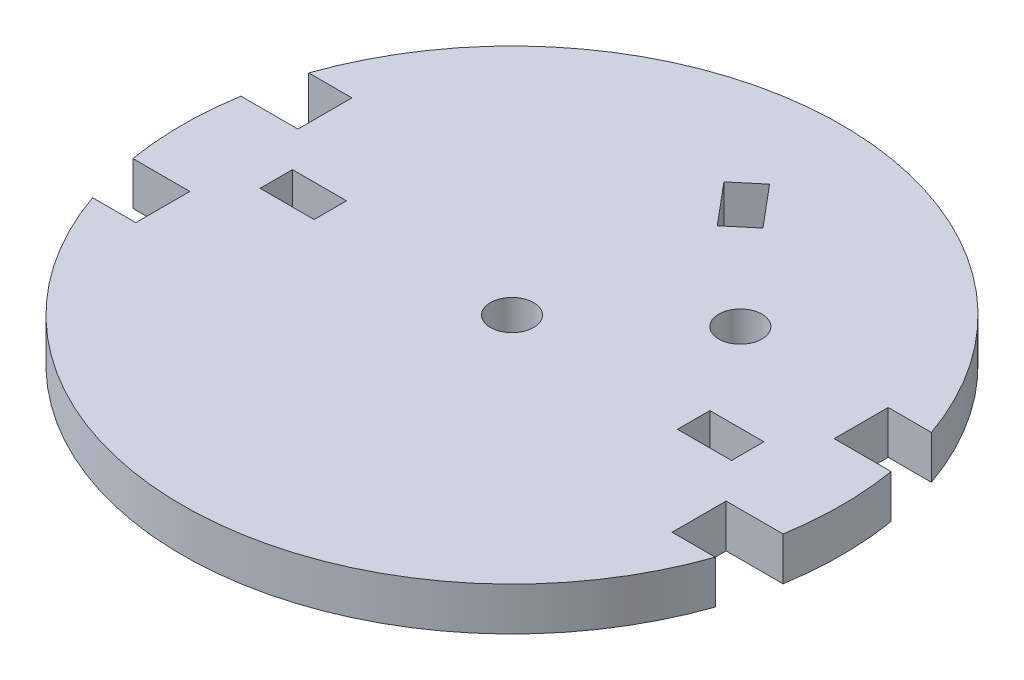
ISO-10303-21;
HEADER;
FILE_DESCRIPTION(('STEP AP214'),'2;1');
FILE_NAME('part.step','',(''),(''),'','','');
FILE_SCHEMA(('AUTOMOTIVE_DESIGN { 1 0 10303 214 1 1 1 1 }'));
ENDSEC;
DATA;
#1=APPLICATION_CONTEXT('core data for automotive mechanical design processes');
#2=APPLICATION_PROTOCOL_DEFINITION('international standard','automotive_design',2000,#1);
#3=PRODUCT_CONTEXT('',#1,'mechanical');
#4=PRODUCT('Part','Part','',(#3));
#5=PRODUCT_RELATED_PRODUCT_CATEGORY('part','',(#4));
#6=PRODUCT_DEFINITION_FORMATION('','',#4);
#7=PRODUCT_DEFINITION_CONTEXT('part definition',#1,'design');
#8=PRODUCT_DEFINITION('design','',#6,#7);
#9=PRODUCT_DEFINITION_SHAPE('','',#8);
#10=(LENGTH_UNIT() NAMED_UNIT(*) SI_UNIT(.MILLI.,.METRE.));
#11=(NAMED_UNIT(*) PLANE_ANGLE_UNIT() SI_UNIT($,.RADIAN.));
#12=(NAMED_UNIT(*) SI_UNIT($,.STERADIAN.) SOLID_ANGLE_UNIT());
#13=UNCERTAINTY_MEASURE_WITH_UNIT(LENGTH_MEASURE(1.E-05),#10,'distance_accuracy_value','');
#14=(GEOMETRIC_REPRESENTATION_CONTEXT(3) GLOBAL_UNCERTAINTY_ASSIGNED_CONTEXT((#13)) GLOBAL_UNIT_ASSIGNED_CONTEXT((#10,
#11,#12)) REPRESENTATION_CONTEXT('',''));
#15=CARTESIAN_POINT('',(0.,0.,0.));
#16=DIRECTION('',(0.,0.,1.));
#17=DIRECTION('',(1.,0.,0.));
#18=AXIS2_PLACEMENT_3D('',#15,#16,#17);
#19=CARTESIAN_POINT('',(0.,4.,0.));
#20=DIRECTION('',(0.,1.,0.));
#21=DIRECTION('',(0.,0.,1.));
#22=AXIS2_PLACEMENT_3D('',#19,#20,#21);
#23=PLANE('',#22);
#24=DIRECTION('',(0.,0.,1.));
#25=VECTOR('',#24,1.);
#26=CARTESIAN_POINT('',(24.8140590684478,4.,0.));
#27=LINE('',#26,#25);
#28=CARTESIAN_POINT('',(24.8140590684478,4.,5.));
#29=VERTEX_POINT('',#28);
#30=CARTESIAN_POINT('',(24.8140590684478,4.,10.));
#31=VERTEX_POINT('',#30);
#32=EDGE_CURVE('E321',#29,#31,#27,.T.);
#33=ORIENTED_EDGE('',*,*,#32,.F.);
#34=DIRECTION('',(1.,0.,0.));
#35=VECTOR('',#34,1.);
#36=CARTESIAN_POINT('',(0.,4.,5.));
#37=LINE('',#36,#35);
#38=CARTESIAN_POINT('',(30.0873727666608,4.,5.));
#39=VERTEX_POINT('',#38);
#40=EDGE_CURVE('E332',#29,#39,#37,.T.);
#41=ORIENTED_EDGE('',*,*,#40,.T.);
#42=CARTESIAN_POINT('',(0.,4.,0.));
#43=DIRECTION('',(0.,1.,0.));
#44=DIRECTION('',(0.,0.,1.));
#45=AXIS2_PLACEMENT_3D('',#42,#43,#44);
#46=CIRCLE('',#45,30.5);
#47=CARTESIAN_POINT('',(30.0873727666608,4.,-5.));
#48=VERTEX_POINT('',#47);
#49=EDGE_CURVE('E44',#39,#48,#46,.T.);
#50=ORIENTED_EDGE('',*,*,#49,.T.);
#51=DIRECTION('',(1.,0.,0.));
#52=VECTOR('',#51,1.);
#53=CARTESIAN_POINT('',(0.,4.,-5.00000000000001));
#54=LINE('',#53,#52);
#55=CARTESIAN_POINT('',(24.8140590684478,4.,-5.));
#56=VERTEX_POINT('',#55);
#57=EDGE_CURVE('E356',#56,#48,#54,.T.);
#58=ORIENTED_EDGE('',*,*,#57,.F.);
#59=DIRECTION('',(0.,0.,-1.));
#60=VECTOR('',#59,1.);
#61=CARTESIAN_POINT('',(24.8140590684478,4.,0.));
#62=LINE('',#61,#60);
#63=CARTESIAN_POINT('',(24.8140590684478,4.,-10.));
#64=VERTEX_POINT('',#63);
#65=EDGE_CURVE('E364',#56,#64,#62,.T.);
#66=ORIENTED_EDGE('',*,*,#65,.T.);
#67=DIRECTION('',(1.,0.,0.));
#68=VECTOR('',#67,1.);
#69=CARTESIAN_POINT('',(0.,4.,-10.));
#70=LINE('',#69,#68);
#71=CARTESIAN_POINT('',(28.8140590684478,4.,-10.));
#72=VERTEX_POINT('',#71);
#73=EDGE_CURVE('E346',#64,#72,#70,.T.);
#74=ORIENTED_EDGE('',*,*,#73,.T.);
#75=CARTESIAN_POINT('',(-28.8140590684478,4.,-10.));
#76=VERTEX_POINT('',#75);
#77=EDGE_CURVE('E589',#72,#76,#46,.T.);
#78=ORIENTED_EDGE('',*,*,#77,.T.);
#79=DIRECTION('',(-1.,0.,0.));
#80=VECTOR('',#79,1.);
#81=CARTESIAN_POINT('',(0.,4.,-10.));
#82=LINE('',#81,#80);
#83=CARTESIAN_POINT('',(-24.8140590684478,4.,-10.));
#84=VERTEX_POINT('',#83);
#85=EDGE_CURVE('E381',#84,#76,#82,.T.);
#86=ORIENTED_EDGE('',*,*,#85,.F.);
#87=DIRECTION('',(0.,0.,-1.));
#88=VECTOR('',#87,1.);
#89=CARTESIAN_POINT('',(-24.8140590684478,4.,0.));
#90=LINE('',#89,#88);
#91=CARTESIAN_POINT('',(-24.8140590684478,4.,-5.));
#92=VERTEX_POINT('',#91);
#93=EDGE_CURVE('E390',#92,#84,#90,.T.);
#94=ORIENTED_EDGE('',*,*,#93,.F.);
#95=DIRECTION('',(-1.,0.,0.));
#96=VECTOR('',#95,1.);
#97=CARTESIAN_POINT('',(0.,4.,-5.));
#98=LINE('',#97,#96);
#99=CARTESIAN_POINT('',(-30.0873727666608,4.,-5.));
#100=VERTEX_POINT('',#99);
#101=EDGE_CURVE('E371',#92,#100,#98,.T.);
#102=ORIENTED_EDGE('',*,*,#101,.T.);
#103=CARTESIAN_POINT('',(-30.0873727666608,4.,5.));
#104=VERTEX_POINT('',#103);
#105=EDGE_CURVE('E45',#100,#104,#46,.T.);
#106=ORIENTED_EDGE('',*,*,#105,.T.);
#107=DIRECTION('',(-1.,0.,0.));
#108=VECTOR('',#107,1.);
#109=CARTESIAN_POINT('',(0.,4.,5.00000000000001));
#110=LINE('',#109,#108);
#111=CARTESIAN_POINT('',(-24.8140590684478,4.,5.));
#112=VERTEX_POINT('',#111);
#113=EDGE_CURVE('E397',#112,#104,#110,.T.);
#114=ORIENTED_EDGE('',*,*,#113,.F.);
#115=DIRECTION('',(0.,0.,1.));
#116=VECTOR('',#115,1.);
#117=CARTESIAN_POINT('',(-24.8140590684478,4.,0.));
#118=LINE('',#117,#116);
#119=CARTESIAN_POINT('',(-24.8140590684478,4.,10.));
#120=VERTEX_POINT('',#119);
#121=EDGE_CURVE('E408',#112,#120,#118,.T.);
#122=ORIENTED_EDGE('',*,*,#121,.T.);
#123=DIRECTION('',(-1.,0.,0.));
#124=VECTOR('',#123,1.);
#125=CARTESIAN_POINT('',(0.,4.,10.));
#126=LINE('',#125,#124);
#127=CARTESIAN_POINT('',(-28.8140590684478,4.,10.));
#128=VERTEX_POINT('',#127);
#129=EDGE_CURVE('E416',#120,#128,#126,.T.);
#130=ORIENTED_EDGE('',*,*,#129,.T.);
#131=CARTESIAN_POINT('',(28.8140590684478,4.,10.));
#132=VERTEX_POINT('',#131);
#133=EDGE_CURVE('E11',#128,#132,#46,.T.);
#134=ORIENTED_EDGE('',*,*,#133,.T.);
#135=DIRECTION('',(1.,0.,0.));
#136=VECTOR('',#135,1.);
#137=CARTESIAN_POINT('',(0.,4.,10.));
#138=LINE('',#137,#136);
#139=EDGE_CURVE('E340',#31,#132,#138,.T.);
#140=ORIENTED_EDGE('',*,*,#139,.F.);
#141=EDGE_LOOP('',(#33,#41,#50,#58,#66,#74,#78,#86,#94,#102,#106,#114,#122,#130,#134,#140));
#142=FACE_BOUND('',#141,.T.);
#143=CARTESIAN_POINT('',(0.,4.,0.));
#144=DIRECTION('',(0.,1.,0.));
#145=DIRECTION('',(0.,0.,1.));
#146=AXIS2_PLACEMENT_3D('',#143,#144,#145);
#147=CIRCLE('',#146,2.);
#148=CARTESIAN_POINT('',(0.,4.,2.));
#149=VERTEX_POINT('',#148);
#150=EDGE_CURVE('E423',#149,#149,#147,.T.);
#151=ORIENTED_EDGE('',*,*,#150,.F.);
#152=EDGE_LOOP('',(#151));
#153=FACE_BOUND('',#152,.T.);
#154=DIRECTION('',(1.,0.,0.));
#155=VECTOR('',#154,1.);
#156=CARTESIAN_POINT('',(-16.8140590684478,4.,1.5));
#157=LINE('',#156,#155);
#158=CARTESIAN_POINT('',(-21.8140590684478,4.,1.5));
#159=VERTEX_POINT('',#158);
#160=CARTESIAN_POINT('',(-16.8140590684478,4.,1.5));
#161=VERTEX_POINT('',#160);
#162=EDGE_CURVE('E289',#159,#161,#157,.T.);
#163=ORIENTED_EDGE('',*,*,#162,.F.);
#164=DIRECTION('',(0.,0.,1.));
#165=VECTOR('',#164,1.);
#166=CARTESIAN_POINT('',(-21.8140590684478,4.,-1.5));
#167=LINE('',#166,#165);
#168=CARTESIAN_POINT('',(-21.8140590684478,4.,-1.5));
#169=VERTEX_POINT('',#168);
#170=EDGE_CURVE('E300',#169,#159,#167,.T.);
#171=ORIENTED_EDGE('',*,*,#170,.F.);
#172=DIRECTION('',(-1.,0.,0.));
#173=VECTOR('',#172,1.);
#174=CARTESIAN_POINT('',(-16.8140590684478,4.,-1.5));
#175=LINE('',#174,#173);
#176=CARTESIAN_POINT('',(-16.8140590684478,4.,-1.5));
#177=VERTEX_POINT('',#176);
#178=EDGE_CURVE('E314',#177,#169,#175,.T.);
#179=ORIENTED_EDGE('',*,*,#178,.F.);
#180=DIRECTION('',(0.,0.,-1.));
#181=VECTOR('',#180,1.);
#182=CARTESIAN_POINT('',(-16.8140590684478,4.,1.5));
#183=LINE('',#182,#181);
#184=EDGE_CURVE('E311',#161,#177,#183,.T.);
#185=ORIENTED_EDGE('',*,*,#184,.F.);
#186=EDGE_LOOP('',(#163,#171,#179,#185));
#187=FACE_BOUND('',#186,.T.);
#188=DIRECTION('',(0.,0.,1.));
#189=VECTOR('',#188,1.);
#190=CARTESIAN_POINT('',(16.8140590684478,4.,1.5));
#191=LINE('',#190,#189);
#192=CARTESIAN_POINT('',(16.8140590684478,4.,-1.5));
#193=VERTEX_POINT('',#192);
#194=CARTESIAN_POINT('',(16.8140590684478,4.,1.5));
#195=VERTEX_POINT('',#194);
#196=EDGE_CURVE('E261',#193,#195,#191,.T.);
#197=ORIENTED_EDGE('',*,*,#196,.F.);
#198=DIRECTION('',(-1.,0.,0.));
#199=VECTOR('',#198,1.);
#200=CARTESIAN_POINT('',(16.8140590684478,4.,-1.5));
#201=LINE('',#200,#199);
#202=CARTESIAN_POINT('',(21.8140590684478,4.,-1.5));
#203=VERTEX_POINT('',#202);
#204=EDGE_CURVE('E268',#203,#193,#201,.T.);
#205=ORIENTED_EDGE('',*,*,#204,.F.);
#206=DIRECTION('',(0.,0.,-1.));
#207=VECTOR('',#206,1.);
#208=CARTESIAN_POINT('',(21.8140590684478,4.,-1.5));
#209=LINE('',#208,#207);
#210=CARTESIAN_POINT('',(21.8140590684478,4.,1.5));
#211=VERTEX_POINT('',#210);
#212=EDGE_CURVE('E282',#211,#203,#209,.T.);
#213=ORIENTED_EDGE('',*,*,#212,.F.);
#214=DIRECTION('',(1.,0.,0.));
#215=VECTOR('',#214,1.);
#216=CARTESIAN_POINT('',(16.8140590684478,4.,1.5));
#217=LINE('',#216,#215);
#218=EDGE_CURVE('E279',#195,#211,#217,.T.);
#219=ORIENTED_EDGE('',*,*,#218,.F.);
#220=EDGE_LOOP('',(#197,#205,#213,#219));
#221=FACE_BOUND('',#220,.T.);
#222=CARTESIAN_POINT('',(11.4906666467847,4.,-9.64181414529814));
#223=DIRECTION('',(0.,1.,0.));
#224=DIRECTION('',(0.,0.,1.));
#225=AXIS2_PLACEMENT_3D('',#222,#223,#224);
#226=CIRCLE('',#225,2.);
#227=CARTESIAN_POINT('',(11.4906666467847,4.,-7.64181414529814));
#228=VERTEX_POINT('',#227);
#229=EDGE_CURVE('E254',#228,#228,#226,.T.);
#230=ORIENTED_EDGE('',*,*,#229,.F.);
#231=EDGE_LOOP('',(#230));
#232=FACE_BOUND('',#231,.T.);
#233=DIRECTION('',(0.64278760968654,0.,0.766044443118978));
#234=VECTOR('',#233,1.);
#235=CARTESIAN_POINT('',(11.8736888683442,4.,-9.96320795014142));
#236=LINE('',#235,#234);
#237=CARTESIAN_POINT('',(1.42839021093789,4.,-22.4114301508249));
#238=VERTEX_POINT('',#237);
#239=CARTESIAN_POINT('',(4.64232825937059,4.,-18.58120793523));
#240=VERTEX_POINT('',#239);
#241=EDGE_CURVE('E248',#238,#240,#236,.T.);
#242=ORIENTED_EDGE('',*,*,#241,.T.);
#243=DIRECTION('',(-0.766044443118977,0.,0.64278760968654));
#244=VECTOR('',#243,1.);
#245=CARTESIAN_POINT('',(-7.23136060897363,4.,-8.61799998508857));
#246=LINE('',#245,#244);
#247=CARTESIAN_POINT('',(2.34419493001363,4.,-16.6528451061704));
#248=VERTEX_POINT('',#247);
#249=EDGE_CURVE('E52',#240,#248,#246,.T.);
#250=ORIENTED_EDGE('',*,*,#249,.T.);
#251=DIRECTION('',(0.642787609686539,0.,0.766044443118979));
#252=VECTOR('',#251,1.);
#253=CARTESIAN_POINT('',(9.57555553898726,4.,-8.03484512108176));
#254=LINE('',#253,#252);
#255=CARTESIAN_POINT('',(-0.86974311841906,4.,-20.4830673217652));
#256=VERTEX_POINT('',#255);
#257=EDGE_CURVE('E239',#256,#248,#254,.T.);
#258=ORIENTED_EDGE('',*,*,#257,.F.);
#259=DIRECTION('',(-0.766044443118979,0.,0.642787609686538));
#260=VECTOR('',#259,1.);
#261=CARTESIAN_POINT('',(-10.4452986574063,4.,-12.4482222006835));
#262=LINE('',#261,#260);
#263=EDGE_CURVE('E242',#238,#256,#262,.T.);
#264=ORIENTED_EDGE('',*,*,#263,.F.);
#265=EDGE_LOOP('',(#242,#250,#258,#264));
#266=FACE_BOUND('',#265,.T.);
#267=ADVANCED_FACE('F35',(#142,#153,#187,#221,#232,#266),#23,.T.);
#268=CARTESIAN_POINT('',(0.,0.,0.));
#269=DIRECTION('',(0.,1.,0.));
#270=DIRECTION('',(0.,0.,1.));
#271=AXIS2_PLACEMENT_3D('',#268,#269,#270);
#272=PLANE('',#271);
#273=DIRECTION('',(1.,0.,0.));
#274=VECTOR('',#273,1.);
#275=CARTESIAN_POINT('',(0.,0.,5.));
#276=LINE('',#275,#274);
#277=CARTESIAN_POINT('',(24.8140590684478,0.,5.));
#278=VERTEX_POINT('',#277);
#279=CARTESIAN_POINT('',(30.0873727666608,0.,5.));
#280=VERTEX_POINT('',#279);
#281=EDGE_CURVE('E335',#278,#280,#276,.T.);
#282=ORIENTED_EDGE('',*,*,#281,.F.);
#283=DIRECTION('',(0.,0.,1.));
#284=VECTOR('',#283,1.);
#285=CARTESIAN_POINT('',(24.8140590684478,0.,0.));
#286=LINE('',#285,#284);
#287=CARTESIAN_POINT('',(24.8140590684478,0.,10.));
#288=VERTEX_POINT('',#287);
#289=EDGE_CURVE('E328',#278,#288,#286,.T.);
#290=ORIENTED_EDGE('',*,*,#289,.T.);
#291=DIRECTION('',(1.,0.,0.));
#292=VECTOR('',#291,1.);
#293=CARTESIAN_POINT('',(0.,0.,10.));
#294=LINE('',#293,#292);
#295=CARTESIAN_POINT('',(28.8140590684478,0.,10.));
#296=VERTEX_POINT('',#295);
#297=EDGE_CURVE('E331',#288,#296,#294,.T.);
#298=ORIENTED_EDGE('',*,*,#297,.T.);
#299=CARTESIAN_POINT('',(0.,0.,0.));
#300=DIRECTION('',(0.,1.,0.));
#301=DIRECTION('',(0.,0.,1.));
#302=AXIS2_PLACEMENT_3D('',#299,#300,#301);
#303=CIRCLE('',#302,30.5);
#304=CARTESIAN_POINT('',(-28.8140590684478,0.,10.));
#305=VERTEX_POINT('',#304);
#306=EDGE_CURVE('E39',#305,#296,#303,.T.);
#307=ORIENTED_EDGE('',*,*,#306,.F.);
#308=DIRECTION('',(-1.,0.,0.));
#309=VECTOR('',#308,1.);
#310=CARTESIAN_POINT('',(0.,0.,10.));
#311=LINE('',#310,#309);
#312=CARTESIAN_POINT('',(-24.8140590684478,0.,10.));
#313=VERTEX_POINT('',#312);
#314=EDGE_CURVE('E407',#313,#305,#311,.T.);
#315=ORIENTED_EDGE('',*,*,#314,.F.);
#316=DIRECTION('',(0.,0.,1.));
#317=VECTOR('',#316,1.);
#318=CARTESIAN_POINT('',(-24.8140590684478,0.,0.));
#319=LINE('',#318,#317);
#320=CARTESIAN_POINT('',(-24.8140590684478,0.,5.));
#321=VERTEX_POINT('',#320);
#322=EDGE_CURVE('E410',#321,#313,#319,.T.);
#323=ORIENTED_EDGE('',*,*,#322,.F.);
#324=DIRECTION('',(-1.,0.,0.));
#325=VECTOR('',#324,1.);
#326=CARTESIAN_POINT('',(0.,0.,5.00000000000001));
#327=LINE('',#326,#325);
#328=CARTESIAN_POINT('',(-30.0873727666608,0.,5.));
#329=VERTEX_POINT('',#328);
#330=EDGE_CURVE('E404',#321,#329,#327,.T.);
#331=ORIENTED_EDGE('',*,*,#330,.T.);
#332=CARTESIAN_POINT('',(-30.0873727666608,0.,-5.));
#333=VERTEX_POINT('',#332);
#334=EDGE_CURVE('E433',#333,#329,#303,.T.);
#335=ORIENTED_EDGE('',*,*,#334,.F.);
#336=DIRECTION('',(-1.,0.,0.));
#337=VECTOR('',#336,1.);
#338=CARTESIAN_POINT('',(0.,0.,-5.));
#339=LINE('',#338,#337);
#340=CARTESIAN_POINT('',(-24.8140590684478,0.,-5.));
#341=VERTEX_POINT('',#340);
#342=EDGE_CURVE('E378',#341,#333,#339,.T.);
#343=ORIENTED_EDGE('',*,*,#342,.F.);
#344=DIRECTION('',(0.,0.,-1.));
#345=VECTOR('',#344,1.);
#346=CARTESIAN_POINT('',(-24.8140590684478,0.,0.));
#347=LINE('',#346,#345);
#348=CARTESIAN_POINT('',(-24.8140590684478,0.,-10.));
#349=VERTEX_POINT('',#348);
#350=EDGE_CURVE('E380',#341,#349,#347,.T.);
#351=ORIENTED_EDGE('',*,*,#350,.T.);
#352=DIRECTION('',(-1.,0.,0.));
#353=VECTOR('',#352,1.);
#354=CARTESIAN_POINT('',(0.,0.,-10.));
#355=LINE('',#354,#353);
#356=CARTESIAN_POINT('',(-28.8140590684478,0.,-10.));
#357=VERTEX_POINT('',#356);
#358=EDGE_CURVE('E384',#349,#357,#355,.T.);
#359=ORIENTED_EDGE('',*,*,#358,.T.);
#360=CARTESIAN_POINT('',(28.8140590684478,0.,-10.));
#361=VERTEX_POINT('',#360);
#362=EDGE_CURVE('E598',#361,#357,#303,.T.);
#363=ORIENTED_EDGE('',*,*,#362,.F.);
#364=DIRECTION('',(1.,0.,0.));
#365=VECTOR('',#364,1.);
#366=CARTESIAN_POINT('',(0.,0.,-10.));
#367=LINE('',#366,#365);
#368=CARTESIAN_POINT('',(24.8140590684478,0.,-10.));
#369=VERTEX_POINT('',#368);
#370=EDGE_CURVE('E353',#369,#361,#367,.T.);
#371=ORIENTED_EDGE('',*,*,#370,.F.);
#372=DIRECTION('',(0.,0.,-1.));
#373=VECTOR('',#372,1.);
#374=CARTESIAN_POINT('',(24.8140590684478,0.,0.));
#375=LINE('',#374,#373);
#376=CARTESIAN_POINT('',(24.8140590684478,0.,-5.));
#377=VERTEX_POINT('',#376);
#378=EDGE_CURVE('E355',#377,#369,#375,.T.);
#379=ORIENTED_EDGE('',*,*,#378,.F.);
#380=DIRECTION('',(1.,0.,0.));
#381=VECTOR('',#380,1.);
#382=CARTESIAN_POINT('',(0.,0.,-5.00000000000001));
#383=LINE('',#382,#381);
#384=CARTESIAN_POINT('',(30.0873727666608,0.,-5.));
#385=VERTEX_POINT('',#384);
#386=EDGE_CURVE('E358',#377,#385,#383,.T.);
#387=ORIENTED_EDGE('',*,*,#386,.T.);
#388=EDGE_CURVE('E583',#280,#385,#303,.T.);
#389=ORIENTED_EDGE('',*,*,#388,.F.);
#390=EDGE_LOOP('',(#282,#290,#298,#307,#315,#323,#331,#335,#343,#351,#359,#363,#371,#379,#387,#389));
#391=FACE_BOUND('',#390,.T.);
#392=CARTESIAN_POINT('',(0.,0.,0.));
#393=DIRECTION('',(0.,1.,0.));
#394=DIRECTION('',(0.,0.,1.));
#395=AXIS2_PLACEMENT_3D('',#392,#393,#394);
#396=CIRCLE('',#395,2.);
#397=CARTESIAN_POINT('',(0.,0.,2.));
#398=VERTEX_POINT('',#397);
#399=EDGE_CURVE('E430',#398,#398,#396,.T.);
#400=ORIENTED_EDGE('',*,*,#399,.T.);
#401=EDGE_LOOP('',(#400));
#402=FACE_BOUND('',#401,.T.);
#403=DIRECTION('',(0.,0.,1.));
#404=VECTOR('',#403,1.);
#405=CARTESIAN_POINT('',(-21.8140590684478,0.,-1.5));
#406=LINE('',#405,#404);
#407=CARTESIAN_POINT('',(-21.8140590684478,0.,-1.5));
#408=VERTEX_POINT('',#407);
#409=CARTESIAN_POINT('',(-21.8140590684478,0.,1.5));
#410=VERTEX_POINT('',#409);
#411=EDGE_CURVE('E306',#408,#410,#406,.T.);
#412=ORIENTED_EDGE('',*,*,#411,.T.);
#413=DIRECTION('',(1.,0.,0.));
#414=VECTOR('',#413,1.);
#415=CARTESIAN_POINT('',(-16.8140590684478,0.,1.5));
#416=LINE('',#415,#414);
#417=CARTESIAN_POINT('',(-16.8140590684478,0.,1.5));
#418=VERTEX_POINT('',#417);
#419=EDGE_CURVE('E296',#410,#418,#416,.T.);
#420=ORIENTED_EDGE('',*,*,#419,.T.);
#421=DIRECTION('',(0.,0.,-1.));
#422=VECTOR('',#421,1.);
#423=CARTESIAN_POINT('',(-16.8140590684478,0.,1.5));
#424=LINE('',#423,#422);
#425=CARTESIAN_POINT('',(-16.8140590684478,0.,-1.5));
#426=VERTEX_POINT('',#425);
#427=EDGE_CURVE('E299',#418,#426,#424,.T.);
#428=ORIENTED_EDGE('',*,*,#427,.T.);
#429=DIRECTION('',(-1.,0.,0.));
#430=VECTOR('',#429,1.);
#431=CARTESIAN_POINT('',(-16.8140590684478,0.,-1.5));
#432=LINE('',#431,#430);
#433=EDGE_CURVE('E303',#426,#408,#432,.T.);
#434=ORIENTED_EDGE('',*,*,#433,.T.);
#435=EDGE_LOOP('',(#412,#420,#428,#434));
#436=FACE_BOUND('',#435,.T.);
#437=DIRECTION('',(-1.,0.,0.));
#438=VECTOR('',#437,1.);
#439=CARTESIAN_POINT('',(16.8140590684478,0.,-1.5));
#440=LINE('',#439,#438);
#441=CARTESIAN_POINT('',(21.8140590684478,0.,-1.5));
#442=VERTEX_POINT('',#441);
#443=CARTESIAN_POINT('',(16.8140590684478,0.,-1.5));
#444=VERTEX_POINT('',#443);
#445=EDGE_CURVE('E274',#442,#444,#440,.T.);
#446=ORIENTED_EDGE('',*,*,#445,.T.);
#447=DIRECTION('',(0.,0.,1.));
#448=VECTOR('',#447,1.);
#449=CARTESIAN_POINT('',(16.8140590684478,0.,1.5));
#450=LINE('',#449,#448);
#451=CARTESIAN_POINT('',(16.8140590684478,0.,1.5));
#452=VERTEX_POINT('',#451);
#453=EDGE_CURVE('E264',#444,#452,#450,.T.);
#454=ORIENTED_EDGE('',*,*,#453,.T.);
#455=DIRECTION('',(1.,0.,0.));
#456=VECTOR('',#455,1.);
#457=CARTESIAN_POINT('',(16.8140590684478,0.,1.5));
#458=LINE('',#457,#456);
#459=CARTESIAN_POINT('',(21.8140590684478,0.,1.5));
#460=VERTEX_POINT('',#459);
#461=EDGE_CURVE('E267',#452,#460,#458,.T.);
#462=ORIENTED_EDGE('',*,*,#461,.T.);
#463=DIRECTION('',(0.,0.,-1.));
#464=VECTOR('',#463,1.);
#465=CARTESIAN_POINT('',(21.8140590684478,0.,-1.5));
#466=LINE('',#465,#464);
#467=EDGE_CURVE('E271',#460,#442,#466,.T.);
#468=ORIENTED_EDGE('',*,*,#467,.T.);
#469=EDGE_LOOP('',(#446,#454,#462,#468));
#470=FACE_BOUND('',#469,.T.);
#471=CARTESIAN_POINT('',(11.4906666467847,0.,-9.64181414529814));
#472=DIRECTION('',(0.,1.,0.));
#473=DIRECTION('',(0.,0.,1.));
#474=AXIS2_PLACEMENT_3D('',#471,#472,#473);
#475=CIRCLE('',#474,2.);
#476=CARTESIAN_POINT('',(11.4906666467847,0.,-7.64181414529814));
#477=VERTEX_POINT('',#476);
#478=EDGE_CURVE('E258',#477,#477,#475,.T.);
#479=ORIENTED_EDGE('',*,*,#478,.T.);
#480=EDGE_LOOP('',(#479));
#481=FACE_BOUND('',#480,.T.);
#482=DIRECTION('',(-0.766044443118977,0.,0.64278760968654));
#483=VECTOR('',#482,1.);
#484=CARTESIAN_POINT('',(-7.23136060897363,0.,-8.61799998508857));
#485=LINE('',#484,#483);
#486=CARTESIAN_POINT('',(4.64232825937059,0.,-18.58120793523));
#487=VERTEX_POINT('',#486);
#488=CARTESIAN_POINT('',(2.34419493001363,0.,-16.6528451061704));
#489=VERTEX_POINT('',#488);
#490=EDGE_CURVE('E230',#487,#489,#485,.T.);
#491=ORIENTED_EDGE('',*,*,#490,.F.);
#492=DIRECTION('',(0.64278760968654,0.,0.766044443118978));
#493=VECTOR('',#492,1.);
#494=CARTESIAN_POINT('',(11.8736888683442,0.,-9.96320795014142));
#495=LINE('',#494,#493);
#496=CARTESIAN_POINT('',(1.4283902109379,0.,-22.4114301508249));
#497=VERTEX_POINT('',#496);
#498=EDGE_CURVE('E222',#497,#487,#495,.T.);
#499=ORIENTED_EDGE('',*,*,#498,.F.);
#500=DIRECTION('',(-0.766044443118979,0.,0.642787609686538));
#501=VECTOR('',#500,1.);
#502=CARTESIAN_POINT('',(-10.4452986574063,0.,-12.4482222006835));
#503=LINE('',#502,#501);
#504=CARTESIAN_POINT('',(-0.86974311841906,0.,-20.4830673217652));
#505=VERTEX_POINT('',#504);
#506=EDGE_CURVE('E60',#497,#505,#503,.T.);
#507=ORIENTED_EDGE('',*,*,#506,.T.);
#508=DIRECTION('',(0.642787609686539,0.,0.766044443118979));
#509=VECTOR('',#508,1.);
#510=CARTESIAN_POINT('',(9.57555553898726,0.,-8.03484512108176));
#511=LINE('',#510,#509);
#512=EDGE_CURVE('E234',#505,#489,#511,.T.);
#513=ORIENTED_EDGE('',*,*,#512,.T.);
#514=EDGE_LOOP('',(#491,#499,#507,#513));
#515=FACE_BOUND('',#514,.T.);
#516=ADVANCED_FACE('F237',(#391,#402,#436,#470,#481,#515),#272,.F.);
#517=CARTESIAN_POINT('',(0.,4.,0.));
#518=DIRECTION('',(0.,-1.,0.));
#519=DIRECTION('',(0.,0.,-1.));
#520=AXIS2_PLACEMENT_3D('',#517,#518,#519);
#521=CYLINDRICAL_SURFACE('',#520,30.5);
#522=DIRECTION('',(0.,1.,0.));
#523=VECTOR('',#522,1.);
#524=CARTESIAN_POINT('',(30.0873727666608,0.,5.));
#525=LINE('',#524,#523);
#526=EDGE_CURVE('E347',#280,#39,#525,.T.);
#527=ORIENTED_EDGE('',*,*,#526,.F.);
#528=ORIENTED_EDGE('',*,*,#388,.T.);
#529=DIRECTION('',(0.,1.,0.));
#530=VECTOR('',#529,1.);
#531=CARTESIAN_POINT('',(30.0873727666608,0.,-5.));
#532=LINE('',#531,#530);
#533=EDGE_CURVE('E372',#385,#48,#532,.T.);
#534=ORIENTED_EDGE('',*,*,#533,.T.);
#535=ORIENTED_EDGE('',*,*,#49,.F.);
#536=EDGE_LOOP('',(#527,#528,#534,#535));
#537=FACE_BOUND('',#536,.T.);
#538=ADVANCED_FACE('F556',(#537),#521,.T.);
#539=DIRECTION('',(0.,1.,0.));
#540=VECTOR('',#539,1.);
#541=CARTESIAN_POINT('',(28.8140590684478,0.,-10.));
#542=LINE('',#541,#540);
#543=EDGE_CURVE('E369',#361,#72,#542,.T.);
#544=ORIENTED_EDGE('',*,*,#543,.F.);
#545=ORIENTED_EDGE('',*,*,#362,.T.);
#546=DIRECTION('',(0.,1.,0.));
#547=VECTOR('',#546,1.);
#548=CARTESIAN_POINT('',(-28.8140590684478,0.,-10.));
#549=LINE('',#548,#547);
#550=EDGE_CURVE('E398',#357,#76,#549,.T.);
#551=ORIENTED_EDGE('',*,*,#550,.T.);
#552=ORIENTED_EDGE('',*,*,#77,.F.);
#553=EDGE_LOOP('',(#544,#545,#551,#552));
#554=FACE_BOUND('',#553,.T.);
#555=ADVANCED_FACE('F561',(#554),#521,.T.);
#556=DIRECTION('',(0.,1.,0.));
#557=VECTOR('',#556,1.);
#558=CARTESIAN_POINT('',(-30.0873727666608,0.,-5.));
#559=LINE('',#558,#557);
#560=EDGE_CURVE('E395',#333,#100,#559,.T.);
#561=ORIENTED_EDGE('',*,*,#560,.F.);
#562=ORIENTED_EDGE('',*,*,#334,.T.);
#563=DIRECTION('',(0.,1.,0.));
#564=VECTOR('',#563,1.);
#565=CARTESIAN_POINT('',(-30.0873727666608,0.,5.));
#566=LINE('',#565,#564);
#567=EDGE_CURVE('E413',#329,#104,#566,.T.);
#568=ORIENTED_EDGE('',*,*,#567,.T.);
#569=ORIENTED_EDGE('',*,*,#105,.F.);
#570=EDGE_LOOP('',(#561,#562,#568,#569));
#571=FACE_BOUND('',#570,.T.);
#572=ADVANCED_FACE('F622',(#571),#521,.T.);
#573=ORIENTED_EDGE('',*,*,#306,.T.);
#574=DIRECTION('',(0.,1.,0.));
#575=VECTOR('',#574,1.);
#576=CARTESIAN_POINT('',(28.8140590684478,0.,10.));
#577=LINE('',#576,#575);
#578=EDGE_CURVE('E349',#296,#132,#577,.T.);
#579=ORIENTED_EDGE('',*,*,#578,.T.);
#580=ORIENTED_EDGE('',*,*,#133,.F.);
#581=DIRECTION('',(0.,1.,0.));
#582=VECTOR('',#581,1.);
#583=CARTESIAN_POINT('',(-28.8140590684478,0.,10.));
#584=LINE('',#583,#582);
#585=EDGE_CURVE('E426',#305,#128,#584,.T.);
#586=ORIENTED_EDGE('',*,*,#585,.F.);
#587=EDGE_LOOP('',(#573,#579,#580,#586));
#588=FACE_BOUND('',#587,.T.);
#589=ADVANCED_FACE('F37',(#588),#521,.T.);
#590=CARTESIAN_POINT('',(0.,0.,0.));
#591=DIRECTION('',(0.,1.,0.));
#592=DIRECTION('',(0.,0.,1.));
#593=AXIS2_PLACEMENT_3D('',#590,#591,#592);
#594=CYLINDRICAL_SURFACE('',#593,2.);
#595=ORIENTED_EDGE('',*,*,#399,.F.);
#596=EDGE_LOOP('',(#595));
#597=FACE_BOUND('',#596,.T.);
#598=ORIENTED_EDGE('',*,*,#150,.T.);
#599=EDGE_LOOP('',(#598));
#600=FACE_BOUND('',#599,.T.);
#601=ADVANCED_FACE('F437',(#597,#600),#594,.F.);
#602=CARTESIAN_POINT('',(0.,0.,5.00000000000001));
#603=DIRECTION('',(0.,0.,-1.));
#604=DIRECTION('',(-1.,0.,0.));
#605=AXIS2_PLACEMENT_3D('',#602,#603,#604);
#606=PLANE('',#605);
#607=ORIENTED_EDGE('',*,*,#113,.T.);
#608=ORIENTED_EDGE('',*,*,#567,.F.);
#609=ORIENTED_EDGE('',*,*,#330,.F.);
#610=DIRECTION('',(0.,1.,0.));
#611=VECTOR('',#610,1.);
#612=CARTESIAN_POINT('',(-24.8140590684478,0.,5.));
#613=LINE('',#612,#611);
#614=EDGE_CURVE('E421',#321,#112,#613,.T.);
#615=ORIENTED_EDGE('',*,*,#614,.T.);
#616=EDGE_LOOP('',(#607,#608,#609,#615));
#617=FACE_BOUND('',#616,.T.);
#618=ADVANCED_FACE('F545',(#617),#606,.F.);
#619=CARTESIAN_POINT('',(-24.8140590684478,0.,0.));
#620=DIRECTION('',(-1.,0.,0.));
#621=DIRECTION('',(0.,0.,1.));
#622=AXIS2_PLACEMENT_3D('',#619,#620,#621);
#623=PLANE('',#622);
#624=ORIENTED_EDGE('',*,*,#121,.F.);
#625=ORIENTED_EDGE('',*,*,#614,.F.);
#626=ORIENTED_EDGE('',*,*,#322,.T.);
#627=DIRECTION('',(0.,1.,0.));
#628=VECTOR('',#627,1.);
#629=CARTESIAN_POINT('',(-24.8140590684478,0.,10.));
#630=LINE('',#629,#628);
#631=EDGE_CURVE('E424',#313,#120,#630,.T.);
#632=ORIENTED_EDGE('',*,*,#631,.T.);
#633=EDGE_LOOP('',(#624,#625,#626,#632));
#634=FACE_BOUND('',#633,.T.);
#635=ADVANCED_FACE('F542',(#634),#623,.T.);
#636=CARTESIAN_POINT('',(0.,0.,10.));
#637=DIRECTION('',(0.,0.,-1.));
#638=DIRECTION('',(-1.,0.,0.));
#639=AXIS2_PLACEMENT_3D('',#636,#637,#638);
#640=PLANE('',#639);
#641=ORIENTED_EDGE('',*,*,#129,.F.);
#642=ORIENTED_EDGE('',*,*,#631,.F.);
#643=ORIENTED_EDGE('',*,*,#314,.T.);
#644=ORIENTED_EDGE('',*,*,#585,.T.);
#645=EDGE_LOOP('',(#641,#642,#643,#644));
#646=FACE_BOUND('',#645,.T.);
#647=ADVANCED_FACE('F540',(#646),#640,.T.);
#648=CARTESIAN_POINT('',(0.,0.,-5.));
#649=DIRECTION('',(0.,0.,-1.));
#650=DIRECTION('',(-1.,0.,0.));
#651=AXIS2_PLACEMENT_3D('',#648,#649,#650);
#652=PLANE('',#651);
#653=ORIENTED_EDGE('',*,*,#101,.F.);
#654=DIRECTION('',(0.,1.,0.));
#655=VECTOR('',#654,1.);
#656=CARTESIAN_POINT('',(-24.8140590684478,0.,-5.));
#657=LINE('',#656,#655);
#658=EDGE_CURVE('E387',#341,#92,#657,.T.);
#659=ORIENTED_EDGE('',*,*,#658,.F.);
#660=ORIENTED_EDGE('',*,*,#342,.T.);
#661=ORIENTED_EDGE('',*,*,#560,.T.);
#662=EDGE_LOOP('',(#653,#659,#660,#661));
#663=FACE_BOUND('',#662,.T.);
#664=ADVANCED_FACE('F533',(#663),#652,.T.);
#665=CARTESIAN_POINT('',(0.,0.,-10.));
#666=DIRECTION('',(0.,0.,-1.));
#667=DIRECTION('',(-1.,0.,0.));
#668=AXIS2_PLACEMENT_3D('',#665,#666,#667);
#669=PLANE('',#668);
#670=ORIENTED_EDGE('',*,*,#85,.T.);
#671=ORIENTED_EDGE('',*,*,#550,.F.);
#672=ORIENTED_EDGE('',*,*,#358,.F.);
#673=DIRECTION('',(0.,1.,0.));
#674=VECTOR('',#673,1.);
#675=CARTESIAN_POINT('',(-24.8140590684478,0.,-10.));
#676=LINE('',#675,#674);
#677=EDGE_CURVE('E401',#349,#84,#676,.T.);
#678=ORIENTED_EDGE('',*,*,#677,.T.);
#679=EDGE_LOOP('',(#670,#671,#672,#678));
#680=FACE_BOUND('',#679,.T.);
#681=ADVANCED_FACE('F530',(#680),#669,.F.);
#682=CARTESIAN_POINT('',(-24.8140590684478,0.,0.));
#683=DIRECTION('',(1.,0.,0.));
#684=DIRECTION('',(0.,0.,-1.));
#685=AXIS2_PLACEMENT_3D('',#682,#683,#684);
#686=PLANE('',#685);
#687=ORIENTED_EDGE('',*,*,#93,.T.);
#688=ORIENTED_EDGE('',*,*,#677,.F.);
#689=ORIENTED_EDGE('',*,*,#350,.F.);
#690=ORIENTED_EDGE('',*,*,#658,.T.);
#691=EDGE_LOOP('',(#687,#688,#689,#690));
#692=FACE_BOUND('',#691,.T.);
#693=ADVANCED_FACE('F528',(#692),#686,.F.);
#694=CARTESIAN_POINT('',(0.,0.,-10.));
#695=DIRECTION('',(0.,0.,1.));
#696=DIRECTION('',(1.,0.,0.));
#697=AXIS2_PLACEMENT_3D('',#694,#695,#696);
#698=PLANE('',#697);
#699=ORIENTED_EDGE('',*,*,#73,.F.);
#700=DIRECTION('',(0.,1.,0.));
#701=VECTOR('',#700,1.);
#702=CARTESIAN_POINT('',(24.8140590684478,0.,-10.));
#703=LINE('',#702,#701);
#704=EDGE_CURVE('E361',#369,#64,#703,.T.);
#705=ORIENTED_EDGE('',*,*,#704,.F.);
#706=ORIENTED_EDGE('',*,*,#370,.T.);
#707=ORIENTED_EDGE('',*,*,#543,.T.);
#708=EDGE_LOOP('',(#699,#705,#706,#707));
#709=FACE_BOUND('',#708,.T.);
#710=ADVANCED_FACE('F521',(#709),#698,.T.);
#711=CARTESIAN_POINT('',(0.,0.,-5.00000000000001));
#712=DIRECTION('',(0.,0.,1.));
#713=DIRECTION('',(1.,0.,0.));
#714=AXIS2_PLACEMENT_3D('',#711,#712,#713);
#715=PLANE('',#714);
#716=ORIENTED_EDGE('',*,*,#57,.T.);
#717=ORIENTED_EDGE('',*,*,#533,.F.);
#718=ORIENTED_EDGE('',*,*,#386,.F.);
#719=DIRECTION('',(0.,1.,0.));
#720=VECTOR('',#719,1.);
#721=CARTESIAN_POINT('',(24.8140590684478,0.,-5.));
#722=LINE('',#721,#720);
#723=EDGE_CURVE('E375',#377,#56,#722,.T.);
#724=ORIENTED_EDGE('',*,*,#723,.T.);
#725=EDGE_LOOP('',(#716,#717,#718,#724));
#726=FACE_BOUND('',#725,.T.);
#727=ADVANCED_FACE('F518',(#726),#715,.F.);
#728=CARTESIAN_POINT('',(24.8140590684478,0.,0.));
#729=DIRECTION('',(1.,0.,0.));
#730=DIRECTION('',(0.,0.,-1.));
#731=AXIS2_PLACEMENT_3D('',#728,#729,#730);
#732=PLANE('',#731);
#733=ORIENTED_EDGE('',*,*,#65,.F.);
#734=ORIENTED_EDGE('',*,*,#723,.F.);
#735=ORIENTED_EDGE('',*,*,#378,.T.);
#736=ORIENTED_EDGE('',*,*,#704,.T.);
#737=EDGE_LOOP('',(#733,#734,#735,#736));
#738=FACE_BOUND('',#737,.T.);
#739=ADVANCED_FACE('F516',(#738),#732,.T.);
#740=CARTESIAN_POINT('',(24.8140590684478,0.,0.));
#741=DIRECTION('',(-1.,0.,0.));
#742=DIRECTION('',(0.,0.,1.));
#743=AXIS2_PLACEMENT_3D('',#740,#741,#742);
#744=PLANE('',#743);
#745=ORIENTED_EDGE('',*,*,#32,.T.);
#746=DIRECTION('',(0.,1.,0.));
#747=VECTOR('',#746,1.);
#748=CARTESIAN_POINT('',(24.8140590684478,0.,10.));
#749=LINE('',#748,#747);
#750=EDGE_CURVE('E337',#288,#31,#749,.T.);
#751=ORIENTED_EDGE('',*,*,#750,.F.);
#752=ORIENTED_EDGE('',*,*,#289,.F.);
#753=DIRECTION('',(0.,1.,0.));
#754=VECTOR('',#753,1.);
#755=CARTESIAN_POINT('',(24.8140590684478,0.,5.));
#756=LINE('',#755,#754);
#757=EDGE_CURVE('E344',#278,#29,#756,.T.);
#758=ORIENTED_EDGE('',*,*,#757,.T.);
#759=EDGE_LOOP('',(#745,#751,#752,#758));
#760=FACE_BOUND('',#759,.T.);
#761=ADVANCED_FACE('F509',(#760),#744,.F.);
#762=CARTESIAN_POINT('',(0.,0.,5.));
#763=DIRECTION('',(0.,0.,1.));
#764=DIRECTION('',(1.,0.,0.));
#765=AXIS2_PLACEMENT_3D('',#762,#763,#764);
#766=PLANE('',#765);
#767=ORIENTED_EDGE('',*,*,#40,.F.);
#768=ORIENTED_EDGE('',*,*,#757,.F.);
#769=ORIENTED_EDGE('',*,*,#281,.T.);
#770=ORIENTED_EDGE('',*,*,#526,.T.);
#771=EDGE_LOOP('',(#767,#768,#769,#770));
#772=FACE_BOUND('',#771,.T.);
#773=ADVANCED_FACE('F506',(#772),#766,.T.);
#774=CARTESIAN_POINT('',(0.,0.,10.));
#775=DIRECTION('',(0.,0.,1.));
#776=DIRECTION('',(1.,0.,0.));
#777=AXIS2_PLACEMENT_3D('',#774,#775,#776);
#778=PLANE('',#777);
#779=ORIENTED_EDGE('',*,*,#139,.T.);
#780=ORIENTED_EDGE('',*,*,#578,.F.);
#781=ORIENTED_EDGE('',*,*,#297,.F.);
#782=ORIENTED_EDGE('',*,*,#750,.T.);
#783=EDGE_LOOP('',(#779,#780,#781,#782));
#784=FACE_BOUND('',#783,.T.);
#785=ADVANCED_FACE('F504',(#784),#778,.F.);
#786=CARTESIAN_POINT('',(-16.8140590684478,0.,1.5));
#787=DIRECTION('',(0.,0.,1.));
#788=DIRECTION('',(1.,0.,0.));
#789=AXIS2_PLACEMENT_3D('',#786,#787,#788);
#790=PLANE('',#789);
#791=ORIENTED_EDGE('',*,*,#162,.T.);
#792=DIRECTION('',(0.,1.,0.));
#793=VECTOR('',#792,1.);
#794=CARTESIAN_POINT('',(-16.8140590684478,0.,1.5));
#795=LINE('',#794,#793);
#796=EDGE_CURVE('E309',#418,#161,#795,.T.);
#797=ORIENTED_EDGE('',*,*,#796,.F.);
#798=ORIENTED_EDGE('',*,*,#419,.F.);
#799=DIRECTION('',(0.,1.,0.));
#800=VECTOR('',#799,1.);
#801=CARTESIAN_POINT('',(-21.8140590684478,0.,1.5));
#802=LINE('',#801,#800);
#803=EDGE_CURVE('E319',#410,#159,#802,.T.);
#804=ORIENTED_EDGE('',*,*,#803,.T.);
#805=EDGE_LOOP('',(#791,#797,#798,#804));
#806=FACE_BOUND('',#805,.T.);
#807=ADVANCED_FACE('F494',(#806),#790,.F.);
#808=CARTESIAN_POINT('',(-21.8140590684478,0.,-1.5));
#809=DIRECTION('',(-1.,0.,0.));
#810=DIRECTION('',(0.,0.,1.));
#811=AXIS2_PLACEMENT_3D('',#808,#809,#810);
#812=PLANE('',#811);
#813=ORIENTED_EDGE('',*,*,#170,.T.);
#814=ORIENTED_EDGE('',*,*,#803,.F.);
#815=ORIENTED_EDGE('',*,*,#411,.F.);
#816=DIRECTION('',(0.,1.,0.));
#817=VECTOR('',#816,1.);
#818=CARTESIAN_POINT('',(-21.8140590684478,0.,-1.5));
#819=LINE('',#818,#817);
#820=EDGE_CURVE('E322',#408,#169,#819,.T.);
#821=ORIENTED_EDGE('',*,*,#820,.T.);
#822=EDGE_LOOP('',(#813,#814,#815,#821));
#823=FACE_BOUND('',#822,.T.);
#824=ADVANCED_FACE('F490',(#823),#812,.F.);
#825=CARTESIAN_POINT('',(-16.8140590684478,0.,-1.5));
#826=DIRECTION('',(0.,0.,-1.));
#827=DIRECTION('',(-1.,0.,0.));
#828=AXIS2_PLACEMENT_3D('',#825,#826,#827);
#829=PLANE('',#828);
#830=ORIENTED_EDGE('',*,*,#178,.T.);
#831=ORIENTED_EDGE('',*,*,#820,.F.);
#832=ORIENTED_EDGE('',*,*,#433,.F.);
#833=DIRECTION('',(0.,1.,0.));
#834=VECTOR('',#833,1.);
#835=CARTESIAN_POINT('',(-16.8140590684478,0.,-1.5));
#836=LINE('',#835,#834);
#837=EDGE_CURVE('E324',#426,#177,#836,.T.);
#838=ORIENTED_EDGE('',*,*,#837,.T.);
#839=EDGE_LOOP('',(#830,#831,#832,#838));
#840=FACE_BOUND('',#839,.T.);
#841=ADVANCED_FACE('F493',(#840),#829,.F.);
#842=CARTESIAN_POINT('',(-16.8140590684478,0.,1.5));
#843=DIRECTION('',(1.,0.,0.));
#844=DIRECTION('',(0.,0.,-1.));
#845=AXIS2_PLACEMENT_3D('',#842,#843,#844);
#846=PLANE('',#845);
#847=ORIENTED_EDGE('',*,*,#184,.T.);
#848=ORIENTED_EDGE('',*,*,#837,.F.);
#849=ORIENTED_EDGE('',*,*,#427,.F.);
#850=ORIENTED_EDGE('',*,*,#796,.T.);
#851=EDGE_LOOP('',(#847,#848,#849,#850));
#852=FACE_BOUND('',#851,.T.);
#853=ADVANCED_FACE('F488',(#852),#846,.F.);
#854=CARTESIAN_POINT('',(16.8140590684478,0.,1.5));
#855=DIRECTION('',(-1.,0.,0.));
#856=DIRECTION('',(0.,0.,1.));
#857=AXIS2_PLACEMENT_3D('',#854,#855,#856);
#858=PLANE('',#857);
#859=ORIENTED_EDGE('',*,*,#196,.T.);
#860=DIRECTION('',(0.,1.,0.));
#861=VECTOR('',#860,1.);
#862=CARTESIAN_POINT('',(16.8140590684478,0.,1.5));
#863=LINE('',#862,#861);
#864=EDGE_CURVE('E277',#452,#195,#863,.T.);
#865=ORIENTED_EDGE('',*,*,#864,.F.);
#866=ORIENTED_EDGE('',*,*,#453,.F.);
#867=DIRECTION('',(0.,1.,0.));
#868=VECTOR('',#867,1.);
#869=CARTESIAN_POINT('',(16.8140590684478,0.,-1.5));
#870=LINE('',#869,#868);
#871=EDGE_CURVE('E287',#444,#193,#870,.T.);
#872=ORIENTED_EDGE('',*,*,#871,.T.);
#873=EDGE_LOOP('',(#859,#865,#866,#872));
#874=FACE_BOUND('',#873,.T.);
#875=ADVANCED_FACE('F478',(#874),#858,.F.);
#876=CARTESIAN_POINT('',(16.8140590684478,0.,-1.5));
#877=DIRECTION('',(0.,0.,-1.));
#878=DIRECTION('',(-1.,0.,0.));
#879=AXIS2_PLACEMENT_3D('',#876,#877,#878);
#880=PLANE('',#879);
#881=ORIENTED_EDGE('',*,*,#204,.T.);
#882=ORIENTED_EDGE('',*,*,#871,.F.);
#883=ORIENTED_EDGE('',*,*,#445,.F.);
#884=DIRECTION('',(0.,1.,0.));
#885=VECTOR('',#884,1.);
#886=CARTESIAN_POINT('',(21.8140590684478,0.,-1.5));
#887=LINE('',#886,#885);
#888=EDGE_CURVE('E290',#442,#203,#887,.T.);
#889=ORIENTED_EDGE('',*,*,#888,.T.);
#890=EDGE_LOOP('',(#881,#882,#883,#889));
#891=FACE_BOUND('',#890,.T.);
#892=ADVANCED_FACE('F474',(#891),#880,.F.);
#893=CARTESIAN_POINT('',(21.8140590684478,0.,-1.5));
#894=DIRECTION('',(1.,0.,0.));
#895=DIRECTION('',(0.,0.,-1.));
#896=AXIS2_PLACEMENT_3D('',#893,#894,#895);
#897=PLANE('',#896);
#898=ORIENTED_EDGE('',*,*,#212,.T.);
#899=ORIENTED_EDGE('',*,*,#888,.F.);
#900=ORIENTED_EDGE('',*,*,#467,.F.);
#901=DIRECTION('',(0.,1.,0.));
#902=VECTOR('',#901,1.);
#903=CARTESIAN_POINT('',(21.8140590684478,0.,1.5));
#904=LINE('',#903,#902);
#905=EDGE_CURVE('E292',#460,#211,#904,.T.);
#906=ORIENTED_EDGE('',*,*,#905,.T.);
#907=EDGE_LOOP('',(#898,#899,#900,#906));
#908=FACE_BOUND('',#907,.T.);
#909=ADVANCED_FACE('F477',(#908),#897,.F.);
#910=CARTESIAN_POINT('',(16.8140590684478,0.,1.5));
#911=DIRECTION('',(0.,0.,1.));
#912=DIRECTION('',(1.,0.,0.));
#913=AXIS2_PLACEMENT_3D('',#910,#911,#912);
#914=PLANE('',#913);
#915=ORIENTED_EDGE('',*,*,#218,.T.);
#916=ORIENTED_EDGE('',*,*,#905,.F.);
#917=ORIENTED_EDGE('',*,*,#461,.F.);
#918=ORIENTED_EDGE('',*,*,#864,.T.);
#919=EDGE_LOOP('',(#915,#916,#917,#918));
#920=FACE_BOUND('',#919,.T.);
#921=ADVANCED_FACE('F472',(#920),#914,.F.);
#922=CARTESIAN_POINT('',(11.4906666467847,0.,-9.64181414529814));
#923=DIRECTION('',(0.,1.,0.));
#924=DIRECTION('',(0.,0.,1.));
#925=AXIS2_PLACEMENT_3D('',#922,#923,#924);
#926=CYLINDRICAL_SURFACE('',#925,2.);
#927=ORIENTED_EDGE('',*,*,#478,.F.);
#928=EDGE_LOOP('',(#927));
#929=FACE_BOUND('',#928,.T.);
#930=ORIENTED_EDGE('',*,*,#229,.T.);
#931=EDGE_LOOP('',(#930));
#932=FACE_BOUND('',#931,.T.);
#933=ADVANCED_FACE('F465',(#929,#932),#926,.F.);
#934=CARTESIAN_POINT('',(-7.23136060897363,0.,-8.61799998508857));
#935=DIRECTION('',(-0.64278760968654,0.,-0.766044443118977));
#936=DIRECTION('',(-0.766044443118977,0.,0.64278760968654));
#937=AXIS2_PLACEMENT_3D('',#934,#935,#936);
#938=PLANE('',#937);
#939=ORIENTED_EDGE('',*,*,#249,.F.);
#940=DIRECTION('',(0.,1.,0.));
#941=VECTOR('',#940,1.);
#942=CARTESIAN_POINT('',(4.64232825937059,0.,-18.58120793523));
#943=LINE('',#942,#941);
#944=EDGE_CURVE('E225',#487,#240,#943,.T.);
#945=ORIENTED_EDGE('',*,*,#944,.F.);
#946=ORIENTED_EDGE('',*,*,#490,.T.);
#947=DIRECTION('',(0.,1.,0.));
#948=VECTOR('',#947,1.);
#949=CARTESIAN_POINT('',(2.34419493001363,0.,-16.6528451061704));
#950=LINE('',#949,#948);
#951=EDGE_CURVE('E252',#489,#248,#950,.T.);
#952=ORIENTED_EDGE('',*,*,#951,.T.);
#953=EDGE_LOOP('',(#939,#945,#946,#952));
#954=FACE_BOUND('',#953,.T.);
#955=ADVANCED_FACE('F232',(#954),#938,.T.);
#956=CARTESIAN_POINT('',(9.57555553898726,0.,-8.03484512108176));
#957=DIRECTION('',(-0.766044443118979,0.,0.642787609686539));
#958=DIRECTION('',(0.642787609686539,0.,0.766044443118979));
#959=AXIS2_PLACEMENT_3D('',#956,#957,#958);
#960=PLANE('',#959);
#961=ORIENTED_EDGE('',*,*,#257,.T.);
#962=ORIENTED_EDGE('',*,*,#951,.F.);
#963=ORIENTED_EDGE('',*,*,#512,.F.);
#964=DIRECTION('',(0.,1.,0.));
#965=VECTOR('',#964,1.);
#966=CARTESIAN_POINT('',(-0.86974311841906,0.,-20.4830673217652));
#967=LINE('',#966,#965);
#968=EDGE_CURVE('E255',#505,#256,#967,.T.);
#969=ORIENTED_EDGE('',*,*,#968,.T.);
#970=EDGE_LOOP('',(#961,#962,#963,#969));
#971=FACE_BOUND('',#970,.T.);
#972=ADVANCED_FACE('F457',(#971),#960,.F.);
#973=CARTESIAN_POINT('',(-10.4452986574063,0.,-12.4482222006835));
#974=DIRECTION('',(-0.642787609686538,0.,-0.766044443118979));
#975=DIRECTION('',(-0.766044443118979,0.,0.642787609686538));
#976=AXIS2_PLACEMENT_3D('',#973,#974,#975);
#977=PLANE('',#976);
#978=ORIENTED_EDGE('',*,*,#263,.T.);
#979=ORIENTED_EDGE('',*,*,#968,.F.);
#980=ORIENTED_EDGE('',*,*,#506,.F.);
#981=DIRECTION('',(0.,1.,0.));
#982=VECTOR('',#981,1.);
#983=CARTESIAN_POINT('',(1.42839021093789,0.,-22.4114301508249));
#984=LINE('',#983,#982);
#985=EDGE_CURVE('E227',#497,#238,#984,.T.);
#986=ORIENTED_EDGE('',*,*,#985,.T.);
#987=EDGE_LOOP('',(#978,#979,#980,#986));
#988=FACE_BOUND('',#987,.T.);
#989=ADVANCED_FACE('F455',(#988),#977,.F.);
#990=CARTESIAN_POINT('',(11.8736888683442,0.,-9.96320795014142));
#991=DIRECTION('',(-0.766044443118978,0.,0.64278760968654));
#992=DIRECTION('',(0.64278760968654,0.,0.766044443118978));
#993=AXIS2_PLACEMENT_3D('',#990,#991,#992);
#994=PLANE('',#993);
#995=ORIENTED_EDGE('',*,*,#241,.F.);
#996=ORIENTED_EDGE('',*,*,#985,.F.);
#997=ORIENTED_EDGE('',*,*,#498,.T.);
#998=ORIENTED_EDGE('',*,*,#944,.T.);
#999=EDGE_LOOP('',(#995,#996,#997,#998));
#1000=FACE_BOUND('',#999,.T.);
#1001=ADVANCED_FACE('F224',(#1000),#994,.T.);
#1002=CLOSED_SHELL('',(#267,#516,#538,#555,#572,#589,#601,#618,#635,#647,#664,#681,#693,#710,
#727,#739,#761,#773,#785,#807,#824,#841,#853,#875,#892,#909,#921,#933,#955,#972,#989,#1001));
#1003=MANIFOLD_SOLID_BREP('B2',#1002);
#1004=ADVANCED_BREP_SHAPE_REPRESENTATION('',(#18,#1003),#14);
#1005=SHAPE_DEFINITION_REPRESENTATION(#9,#1004);
ENDSEC;
END-ISO-10303-21;
